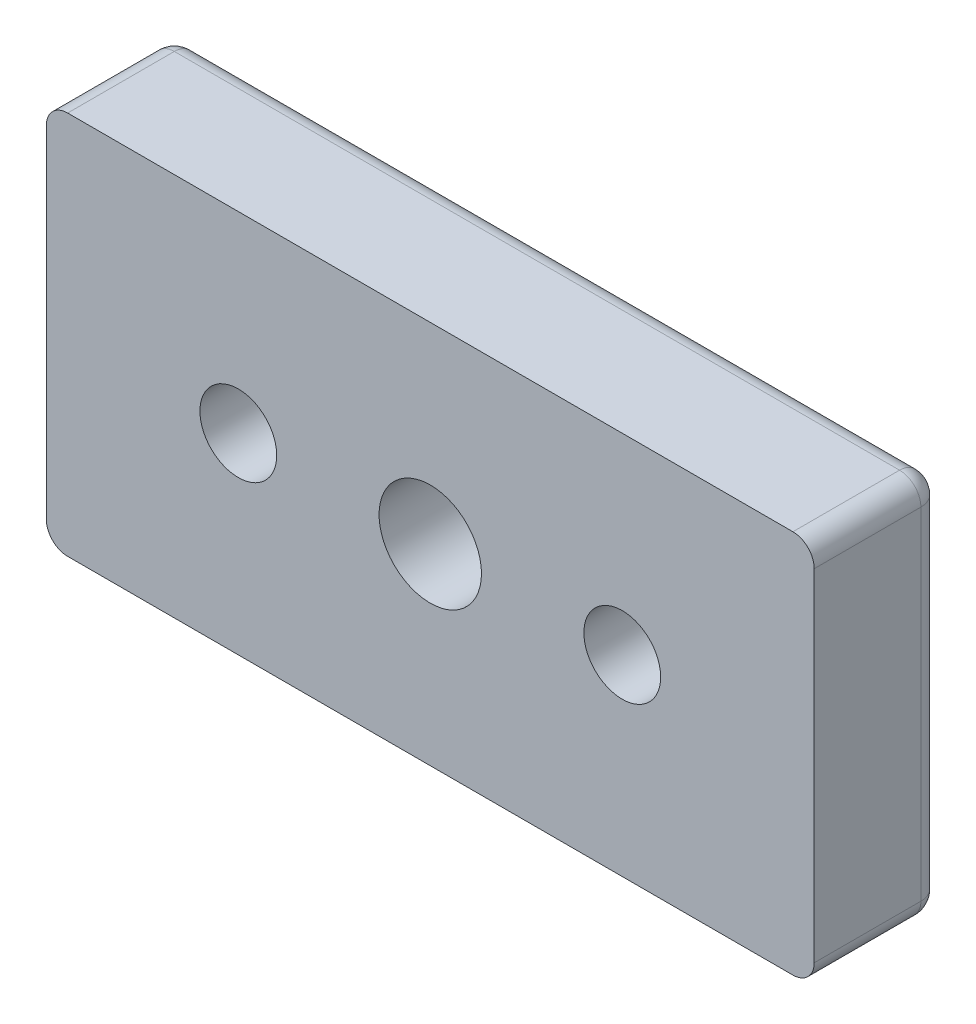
ISO-10303-21;
HEADER;
FILE_DESCRIPTION(('STEP AP214'),'2;1');
FILE_NAME('part.step','',(''),(''),'','','');
FILE_SCHEMA(('AUTOMOTIVE_DESIGN { 1 0 10303 214 1 1 1 1 }'));
ENDSEC;
DATA;
#1=APPLICATION_CONTEXT('core data for automotive mechanical design processes');
#2=APPLICATION_PROTOCOL_DEFINITION('international standard','automotive_design',2000,#1);
#3=PRODUCT_CONTEXT('',#1,'mechanical');
#4=PRODUCT('Part','Part','',(#3));
#5=PRODUCT_RELATED_PRODUCT_CATEGORY('part','',(#4));
#6=PRODUCT_DEFINITION_FORMATION('','',#4);
#7=PRODUCT_DEFINITION_CONTEXT('part definition',#1,'design');
#8=PRODUCT_DEFINITION('design','',#6,#7);
#9=PRODUCT_DEFINITION_SHAPE('','',#8);
#10=(LENGTH_UNIT() NAMED_UNIT(*) SI_UNIT(.MILLI.,.METRE.));
#11=(NAMED_UNIT(*) PLANE_ANGLE_UNIT() SI_UNIT($,.RADIAN.));
#12=(NAMED_UNIT(*) SI_UNIT($,.STERADIAN.) SOLID_ANGLE_UNIT());
#13=UNCERTAINTY_MEASURE_WITH_UNIT(LENGTH_MEASURE(1.E-05),#10,'distance_accuracy_value','');
#14=(GEOMETRIC_REPRESENTATION_CONTEXT(3) GLOBAL_UNCERTAINTY_ASSIGNED_CONTEXT((#13)) GLOBAL_UNIT_ASSIGNED_CONTEXT((#10,
#11,#12)) REPRESENTATION_CONTEXT('',''));
#15=CARTESIAN_POINT('',(0.,0.,0.));
#16=DIRECTION('',(0.,0.,1.));
#17=DIRECTION('',(1.,0.,0.));
#18=AXIS2_PLACEMENT_3D('',#15,#16,#17);
#19=CARTESIAN_POINT('',(22.5,0.,0.));
#20=DIRECTION('',(0.,0.,1.));
#21=DIRECTION('',(1.,0.,0.));
#22=AXIS2_PLACEMENT_3D('',#19,#20,#21);
#23=CYLINDRICAL_SURFACE('',#22,7.5);
#24=CARTESIAN_POINT('',(22.5,0.,5.5));
#25=DIRECTION('',(0.,0.,1.));
#26=DIRECTION('',(1.,0.,0.));
#27=AXIS2_PLACEMENT_3D('',#24,#25,#26);
#28=CIRCLE('',#27,7.5);
#29=CARTESIAN_POINT('',(30.,0.,5.5));
#30=VERTEX_POINT('',#29);
#31=EDGE_CURVE('E111',#30,#30,#28,.T.);
#32=ORIENTED_EDGE('',*,*,#31,.T.);
#33=EDGE_LOOP('',(#32));
#34=FACE_BOUND('',#33,.T.);
#35=CARTESIAN_POINT('',(22.5,0.,0.));
#36=DIRECTION('',(0.,0.,1.));
#37=DIRECTION('',(1.,0.,0.));
#38=AXIS2_PLACEMENT_3D('',#35,#36,#37);
#39=CIRCLE('',#38,7.5);
#40=CARTESIAN_POINT('',(30.,0.,0.));
#41=VERTEX_POINT('',#40);
#42=EDGE_CURVE('E113',#41,#41,#39,.F.);
#43=ORIENTED_EDGE('',*,*,#42,.T.);
#44=EDGE_LOOP('',(#43));
#45=FACE_BOUND('',#44,.T.);
#46=ADVANCED_FACE('F15',(#34,#45),#23,.F.);
#47=CARTESIAN_POINT('',(-22.5,0.,0.));
#48=DIRECTION('',(0.,0.,1.));
#49=DIRECTION('',(1.,0.,0.));
#50=AXIS2_PLACEMENT_3D('',#47,#48,#49);
#51=CYLINDRICAL_SURFACE('',#50,7.5);
#52=CARTESIAN_POINT('',(-22.5,0.,5.5));
#53=DIRECTION('',(0.,0.,1.));
#54=DIRECTION('',(1.,0.,0.));
#55=AXIS2_PLACEMENT_3D('',#52,#53,#54);
#56=CIRCLE('',#55,7.5);
#57=CARTESIAN_POINT('',(-15.,0.,5.5));
#58=VERTEX_POINT('',#57);
#59=EDGE_CURVE('E107',#58,#58,#56,.T.);
#60=ORIENTED_EDGE('',*,*,#59,.T.);
#61=EDGE_LOOP('',(#60));
#62=FACE_BOUND('',#61,.T.);
#63=CARTESIAN_POINT('',(-22.5,0.,0.));
#64=DIRECTION('',(0.,0.,1.));
#65=DIRECTION('',(1.,0.,0.));
#66=AXIS2_PLACEMENT_3D('',#63,#64,#65);
#67=CIRCLE('',#66,7.5);
#68=CARTESIAN_POINT('',(-15.,0.,0.));
#69=VERTEX_POINT('',#68);
#70=EDGE_CURVE('E19',#69,#69,#67,.F.);
#71=ORIENTED_EDGE('',*,*,#70,.T.);
#72=EDGE_LOOP('',(#71));
#73=FACE_BOUND('',#72,.T.);
#74=ADVANCED_FACE('F288',(#62,#73),#51,.F.);
#75=CARTESIAN_POINT('',(-21.25,20.,2.5));
#76=DIRECTION('',(-1.,0.,0.));
#77=DIRECTION('',(0.,0.,1.));
#78=AXIS2_PLACEMENT_3D('',#75,#76,#77);
#79=CYLINDRICAL_SURFACE('',#78,2.5);
#80=CARTESIAN_POINT('',(-42.5,20.,2.5));
#81=DIRECTION('',(1.,0.,0.));
#82=DIRECTION('',(0.,1.,0.));
#83=AXIS2_PLACEMENT_3D('',#80,#81,#82);
#84=CIRCLE('',#83,2.5);
#85=CARTESIAN_POINT('',(-42.5,22.5,2.5));
#86=VERTEX_POINT('',#85);
#87=CARTESIAN_POINT('',(-42.5,20.,0.));
#88=VERTEX_POINT('',#87);
#89=EDGE_CURVE('E235',#86,#88,#84,.F.);
#90=ORIENTED_EDGE('',*,*,#89,.F.);
#91=DIRECTION('',(1.,0.,0.));
#92=VECTOR('',#91,1.);
#93=CARTESIAN_POINT('',(-42.5,22.5,2.5));
#94=LINE('',#93,#92);
#95=CARTESIAN_POINT('',(42.5,22.5,2.5));
#96=VERTEX_POINT('',#95);
#97=EDGE_CURVE('E110',#96,#86,#94,.F.);
#98=ORIENTED_EDGE('',*,*,#97,.F.);
#99=CARTESIAN_POINT('',(42.5,20.,2.5));
#100=DIRECTION('',(1.,0.,0.));
#101=DIRECTION('',(0.,1.,0.));
#102=AXIS2_PLACEMENT_3D('',#99,#100,#101);
#103=CIRCLE('',#102,2.5);
#104=CARTESIAN_POINT('',(42.5,20.,0.));
#105=VERTEX_POINT('',#104);
#106=EDGE_CURVE('E249',#105,#96,#103,.T.);
#107=ORIENTED_EDGE('',*,*,#106,.F.);
#108=DIRECTION('',(1.,0.,0.));
#109=VECTOR('',#108,1.);
#110=CARTESIAN_POINT('',(0.,20.,0.));
#111=LINE('',#110,#109);
#112=EDGE_CURVE('E131',#105,#88,#111,.F.);
#113=ORIENTED_EDGE('',*,*,#112,.T.);
#114=EDGE_LOOP('',(#90,#98,#107,#113));
#115=FACE_BOUND('',#114,.T.);
#116=ADVANCED_FACE('F228',(#115),#79,.T.);
#117=CARTESIAN_POINT('',(-42.5,20.,2.5));
#118=DIRECTION('',(1.,0.,0.));
#119=DIRECTION('',(0.,1.,0.));
#120=AXIS2_PLACEMENT_3D('',#117,#118,#119);
#121=SPHERICAL_SURFACE('',#120,2.5);
#122=CARTESIAN_POINT('',(-42.5,20.,2.5));
#123=DIRECTION('',(0.,0.,1.));
#124=DIRECTION('',(1.,0.,0.));
#125=AXIS2_PLACEMENT_3D('',#122,#123,#124);
#126=CIRCLE('',#125,2.5);
#127=CARTESIAN_POINT('',(-45.,20.,2.5));
#128=VERTEX_POINT('',#127);
#129=EDGE_CURVE('E73',#86,#128,#126,.T.);
#130=ORIENTED_EDGE('',*,*,#129,.F.);
#131=ORIENTED_EDGE('',*,*,#89,.T.);
#132=CARTESIAN_POINT('',(-42.5,20.,2.5));
#133=DIRECTION('',(0.,-1.,0.));
#134=DIRECTION('',(0.,0.,-1.));
#135=AXIS2_PLACEMENT_3D('',#132,#133,#134);
#136=CIRCLE('',#135,2.5);
#137=EDGE_CURVE('E234',#128,#88,#136,.T.);
#138=ORIENTED_EDGE('',*,*,#137,.F.);
#139=EDGE_LOOP('',(#130,#131,#138));
#140=FACE_BOUND('',#139,.T.);
#141=ADVANCED_FACE('F223',(#140),#121,.T.);
#142=CARTESIAN_POINT('',(-42.5,-10.,2.5));
#143=DIRECTION('',(0.,-1.,0.));
#144=DIRECTION('',(0.,0.,-1.));
#145=AXIS2_PLACEMENT_3D('',#142,#143,#144);
#146=CYLINDRICAL_SURFACE('',#145,2.5);
#147=CARTESIAN_POINT('',(-42.5,-20.,2.5));
#148=DIRECTION('',(0.,1.,0.));
#149=DIRECTION('',(1.,0.,0.));
#150=AXIS2_PLACEMENT_3D('',#147,#148,#149);
#151=CIRCLE('',#150,2.5);
#152=CARTESIAN_POINT('',(-45.,-20.,2.5));
#153=VERTEX_POINT('',#152);
#154=CARTESIAN_POINT('',(-42.5,-20.,0.));
#155=VERTEX_POINT('',#154);
#156=EDGE_CURVE('E211',#153,#155,#151,.F.);
#157=ORIENTED_EDGE('',*,*,#156,.F.);
#158=DIRECTION('',(0.,1.,0.));
#159=VECTOR('',#158,1.);
#160=CARTESIAN_POINT('',(-45.,-20.,2.5));
#161=LINE('',#160,#159);
#162=EDGE_CURVE('E77',#128,#153,#161,.F.);
#163=ORIENTED_EDGE('',*,*,#162,.F.);
#164=ORIENTED_EDGE('',*,*,#137,.T.);
#165=DIRECTION('',(0.,1.,0.));
#166=VECTOR('',#165,1.);
#167=CARTESIAN_POINT('',(-42.5,0.,0.));
#168=LINE('',#167,#166);
#169=EDGE_CURVE('E122',#88,#155,#168,.F.);
#170=ORIENTED_EDGE('',*,*,#169,.T.);
#171=EDGE_LOOP('',(#157,#163,#164,#170));
#172=FACE_BOUND('',#171,.T.);
#173=ADVANCED_FACE('F219',(#172),#146,.T.);
#174=CARTESIAN_POINT('',(-42.5,-20.,2.5));
#175=DIRECTION('',(1.,0.,0.));
#176=DIRECTION('',(0.,1.,0.));
#177=AXIS2_PLACEMENT_3D('',#174,#175,#176);
#178=SPHERICAL_SURFACE('',#177,2.5);
#179=CARTESIAN_POINT('',(-42.5,-20.,2.5));
#180=DIRECTION('',(0.,0.,1.));
#181=DIRECTION('',(1.,0.,0.));
#182=AXIS2_PLACEMENT_3D('',#179,#180,#181);
#183=CIRCLE('',#182,2.50000000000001);
#184=CARTESIAN_POINT('',(-42.5,-22.5,2.5));
#185=VERTEX_POINT('',#184);
#186=EDGE_CURVE('E76',#153,#185,#183,.T.);
#187=ORIENTED_EDGE('',*,*,#186,.F.);
#188=ORIENTED_EDGE('',*,*,#156,.T.);
#189=CARTESIAN_POINT('',(-42.5,-20.,2.5));
#190=DIRECTION('',(1.,0.,0.));
#191=DIRECTION('',(0.,0.,-1.));
#192=AXIS2_PLACEMENT_3D('',#189,#190,#191);
#193=CIRCLE('',#192,2.5);
#194=EDGE_CURVE('E207',#185,#155,#193,.T.);
#195=ORIENTED_EDGE('',*,*,#194,.F.);
#196=EDGE_LOOP('',(#187,#188,#195));
#197=FACE_BOUND('',#196,.T.);
#198=ADVANCED_FACE('F216',(#197),#178,.T.);
#199=CARTESIAN_POINT('',(21.25,-20.,2.5));
#200=DIRECTION('',(1.,0.,0.));
#201=DIRECTION('',(0.,0.,-1.));
#202=AXIS2_PLACEMENT_3D('',#199,#200,#201);
#203=CYLINDRICAL_SURFACE('',#202,2.5);
#204=CARTESIAN_POINT('',(42.5,-20.,2.5));
#205=DIRECTION('',(1.,0.,0.));
#206=DIRECTION('',(0.,1.,0.));
#207=AXIS2_PLACEMENT_3D('',#204,#205,#206);
#208=CIRCLE('',#207,2.5);
#209=CARTESIAN_POINT('',(42.5,-22.5,2.50000000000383));
#210=VERTEX_POINT('',#209);
#211=CARTESIAN_POINT('',(42.5,-20.,0.));
#212=VERTEX_POINT('',#211);
#213=EDGE_CURVE('E203',#210,#212,#208,.T.);
#214=ORIENTED_EDGE('',*,*,#213,.F.);
#215=DIRECTION('',(1.,0.,0.));
#216=VECTOR('',#215,1.);
#217=CARTESIAN_POINT('',(42.5,-22.5,2.5));
#218=LINE('',#217,#216);
#219=EDGE_CURVE('E169',#185,#210,#218,.T.);
#220=ORIENTED_EDGE('',*,*,#219,.F.);
#221=ORIENTED_EDGE('',*,*,#194,.T.);
#222=DIRECTION('',(1.,0.,0.));
#223=VECTOR('',#222,1.);
#224=CARTESIAN_POINT('',(0.,-20.,0.));
#225=LINE('',#224,#223);
#226=EDGE_CURVE('E118',#155,#212,#225,.T.);
#227=ORIENTED_EDGE('',*,*,#226,.T.);
#228=EDGE_LOOP('',(#214,#220,#221,#227));
#229=FACE_BOUND('',#228,.T.);
#230=ADVANCED_FACE('F196',(#229),#203,.T.);
#231=CARTESIAN_POINT('',(42.5,-20.,2.5));
#232=DIRECTION('',(1.,0.,0.));
#233=DIRECTION('',(0.,1.,0.));
#234=AXIS2_PLACEMENT_3D('',#231,#232,#233);
#235=SPHERICAL_SURFACE('',#234,2.5);
#236=CARTESIAN_POINT('',(42.5,-20.,2.5));
#237=DIRECTION('',(0.,0.,1.));
#238=DIRECTION('',(1.,0.,0.));
#239=AXIS2_PLACEMENT_3D('',#236,#237,#238);
#240=CIRCLE('',#239,2.5);
#241=CARTESIAN_POINT('',(45.,-20.,2.5));
#242=VERTEX_POINT('',#241);
#243=EDGE_CURVE('E165',#210,#242,#240,.T.);
#244=ORIENTED_EDGE('',*,*,#243,.F.);
#245=ORIENTED_EDGE('',*,*,#213,.T.);
#246=CARTESIAN_POINT('',(42.5,-20.,2.5));
#247=DIRECTION('',(0.,1.,0.));
#248=DIRECTION('',(0.,0.,1.));
#249=AXIS2_PLACEMENT_3D('',#246,#247,#248);
#250=CIRCLE('',#249,2.5);
#251=EDGE_CURVE('E206',#242,#212,#250,.T.);
#252=ORIENTED_EDGE('',*,*,#251,.F.);
#253=EDGE_LOOP('',(#244,#245,#252));
#254=FACE_BOUND('',#253,.T.);
#255=ADVANCED_FACE('F191',(#254),#235,.T.);
#256=CARTESIAN_POINT('',(42.5,10.,2.5));
#257=DIRECTION('',(0.,1.,0.));
#258=DIRECTION('',(0.,0.,1.));
#259=AXIS2_PLACEMENT_3D('',#256,#257,#258);
#260=CYLINDRICAL_SURFACE('',#259,2.5);
#261=CARTESIAN_POINT('',(42.5,20.,2.5));
#262=DIRECTION('',(0.,1.,0.));
#263=DIRECTION('',(1.,0.,0.));
#264=AXIS2_PLACEMENT_3D('',#261,#262,#263);
#265=CIRCLE('',#264,2.5);
#266=CARTESIAN_POINT('',(45.,20.,2.5));
#267=VERTEX_POINT('',#266);
#268=EDGE_CURVE('E178',#267,#105,#265,.T.);
#269=ORIENTED_EDGE('',*,*,#268,.F.);
#270=DIRECTION('',(0.,1.,0.));
#271=VECTOR('',#270,1.);
#272=CARTESIAN_POINT('',(45.,20.,2.5));
#273=LINE('',#272,#271);
#274=EDGE_CURVE('E161',#242,#267,#273,.T.);
#275=ORIENTED_EDGE('',*,*,#274,.F.);
#276=ORIENTED_EDGE('',*,*,#251,.T.);
#277=DIRECTION('',(0.,1.,0.));
#278=VECTOR('',#277,1.);
#279=CARTESIAN_POINT('',(42.5,0.,0.));
#280=LINE('',#279,#278);
#281=EDGE_CURVE('E134',#212,#105,#280,.T.);
#282=ORIENTED_EDGE('',*,*,#281,.T.);
#283=EDGE_LOOP('',(#269,#275,#276,#282));
#284=FACE_BOUND('',#283,.T.);
#285=ADVANCED_FACE('F186',(#284),#260,.T.);
#286=CARTESIAN_POINT('',(42.5,20.,2.5));
#287=DIRECTION('',(1.,0.,0.));
#288=DIRECTION('',(0.,1.,0.));
#289=AXIS2_PLACEMENT_3D('',#286,#287,#288);
#290=SPHERICAL_SURFACE('',#289,2.5);
#291=CARTESIAN_POINT('',(42.5,20.,2.5));
#292=DIRECTION('',(0.,0.,1.));
#293=DIRECTION('',(1.,0.,0.));
#294=AXIS2_PLACEMENT_3D('',#291,#292,#293);
#295=CIRCLE('',#294,2.5);
#296=EDGE_CURVE('E156',#267,#96,#295,.T.);
#297=ORIENTED_EDGE('',*,*,#296,.F.);
#298=ORIENTED_EDGE('',*,*,#268,.T.);
#299=ORIENTED_EDGE('',*,*,#106,.T.);
#300=EDGE_LOOP('',(#297,#298,#299));
#301=FACE_BOUND('',#300,.T.);
#302=ADVANCED_FACE('F181',(#301),#290,.T.);
#303=CARTESIAN_POINT('',(0.,0.,0.));
#304=DIRECTION('',(0.,0.,1.));
#305=DIRECTION('',(1.,0.,0.));
#306=AXIS2_PLACEMENT_3D('',#303,#304,#305);
#307=PLANE('',#306);
#308=ORIENTED_EDGE('',*,*,#42,.F.);
#309=EDGE_LOOP('',(#308));
#310=FACE_BOUND('',#309,.T.);
#311=ORIENTED_EDGE('',*,*,#70,.F.);
#312=EDGE_LOOP('',(#311));
#313=FACE_BOUND('',#312,.T.);
#314=CARTESIAN_POINT('',(0.,0.,0.));
#315=DIRECTION('',(0.,0.,1.));
#316=DIRECTION('',(1.,0.,0.));
#317=AXIS2_PLACEMENT_3D('',#314,#315,#316);
#318=CIRCLE('',#317,6.);
#319=CARTESIAN_POINT('',(6.,0.,0.));
#320=VERTEX_POINT('',#319);
#321=EDGE_CURVE('E104',#320,#320,#318,.T.);
#322=ORIENTED_EDGE('',*,*,#321,.T.);
#323=EDGE_LOOP('',(#322));
#324=FACE_BOUND('',#323,.T.);
#325=ORIENTED_EDGE('',*,*,#169,.F.);
#326=ORIENTED_EDGE('',*,*,#112,.F.);
#327=ORIENTED_EDGE('',*,*,#281,.F.);
#328=ORIENTED_EDGE('',*,*,#226,.F.);
#329=EDGE_LOOP('',(#325,#326,#327,#328));
#330=FACE_BOUND('',#329,.T.);
#331=ADVANCED_FACE('F185',(#310,#313,#324,#330),#307,.F.);
#332=CARTESIAN_POINT('',(30.15,7.65,5.5));
#333=DIRECTION('',(0.,0.,1.));
#334=DIRECTION('',(-1.,0.,0.));
#335=AXIS2_PLACEMENT_3D('',#332,#333,#334);
#336=PLANE('',#335);
#337=CARTESIAN_POINT('',(22.5,0.,5.5));
#338=DIRECTION('',(0.,0.,1.));
#339=DIRECTION('',(1.,0.,0.));
#340=AXIS2_PLACEMENT_3D('',#337,#338,#339);
#341=CIRCLE('',#340,4.5);
#342=CARTESIAN_POINT('',(27.,0.,5.5));
#343=VERTEX_POINT('',#342);
#344=EDGE_CURVE('E101',#343,#343,#341,.T.);
#345=ORIENTED_EDGE('',*,*,#344,.T.);
#346=EDGE_LOOP('',(#345));
#347=FACE_BOUND('',#346,.T.);
#348=ORIENTED_EDGE('',*,*,#31,.F.);
#349=EDGE_LOOP('',(#348));
#350=FACE_BOUND('',#349,.T.);
#351=ADVANCED_FACE('F335',(#347,#350),#336,.F.);
#352=CARTESIAN_POINT('',(-14.85,7.65,5.5));
#353=DIRECTION('',(0.,0.,1.));
#354=DIRECTION('',(-1.,0.,0.));
#355=AXIS2_PLACEMENT_3D('',#352,#353,#354);
#356=PLANE('',#355);
#357=CARTESIAN_POINT('',(-22.5,0.,5.5));
#358=DIRECTION('',(0.,0.,1.));
#359=DIRECTION('',(1.,0.,0.));
#360=AXIS2_PLACEMENT_3D('',#357,#358,#359);
#361=CIRCLE('',#360,4.5);
#362=CARTESIAN_POINT('',(-18.,0.,5.5));
#363=VERTEX_POINT('',#362);
#364=EDGE_CURVE('E94',#363,#363,#361,.T.);
#365=ORIENTED_EDGE('',*,*,#364,.T.);
#366=EDGE_LOOP('',(#365));
#367=FACE_BOUND('',#366,.T.);
#368=ORIENTED_EDGE('',*,*,#59,.F.);
#369=EDGE_LOOP('',(#368));
#370=FACE_BOUND('',#369,.T.);
#371=ADVANCED_FACE('F17',(#367,#370),#356,.F.);
#372=CARTESIAN_POINT('',(-42.5,22.5,0.));
#373=DIRECTION('',(0.,1.,0.));
#374=DIRECTION('',(0.,0.,1.));
#375=AXIS2_PLACEMENT_3D('',#372,#373,#374);
#376=PLANE('',#375);
#377=DIRECTION('',(1.,0.,0.));
#378=VECTOR('',#377,1.);
#379=CARTESIAN_POINT('',(0.,22.5,15.));
#380=LINE('',#379,#378);
#381=CARTESIAN_POINT('',(42.5,22.5,15.));
#382=VERTEX_POINT('',#381);
#383=CARTESIAN_POINT('',(-42.5,22.5,15.));
#384=VERTEX_POINT('',#383);
#385=EDGE_CURVE('E92',#382,#384,#380,.F.);
#386=ORIENTED_EDGE('',*,*,#385,.F.);
#387=DIRECTION('',(0.,0.,1.));
#388=VECTOR('',#387,1.);
#389=CARTESIAN_POINT('',(42.5,22.5,0.));
#390=LINE('',#389,#388);
#391=EDGE_CURVE('E153',#96,#382,#390,.T.);
#392=ORIENTED_EDGE('',*,*,#391,.F.);
#393=ORIENTED_EDGE('',*,*,#97,.T.);
#394=DIRECTION('',(0.,0.,1.));
#395=VECTOR('',#394,1.);
#396=CARTESIAN_POINT('',(-42.5,22.5,0.));
#397=LINE('',#396,#395);
#398=EDGE_CURVE('E59',#384,#86,#397,.F.);
#399=ORIENTED_EDGE('',*,*,#398,.F.);
#400=EDGE_LOOP('',(#386,#392,#393,#399));
#401=FACE_BOUND('',#400,.T.);
#402=ADVANCED_FACE('F268',(#401),#376,.T.);
#403=CARTESIAN_POINT('',(-42.5,20.,0.));
#404=DIRECTION('',(0.,0.,1.));
#405=DIRECTION('',(1.,0.,0.));
#406=AXIS2_PLACEMENT_3D('',#403,#404,#405);
#407=CYLINDRICAL_SURFACE('',#406,2.5);
#408=CARTESIAN_POINT('',(-42.5,20.,15.));
#409=DIRECTION('',(0.,0.,1.));
#410=DIRECTION('',(1.,0.,0.));
#411=AXIS2_PLACEMENT_3D('',#408,#409,#410);
#412=CIRCLE('',#411,2.5);
#413=CARTESIAN_POINT('',(-45.,20.,15.));
#414=VERTEX_POINT('',#413);
#415=EDGE_CURVE('E69',#384,#414,#412,.T.);
#416=ORIENTED_EDGE('',*,*,#415,.F.);
#417=ORIENTED_EDGE('',*,*,#398,.T.);
#418=ORIENTED_EDGE('',*,*,#129,.T.);
#419=DIRECTION('',(0.,0.,1.));
#420=VECTOR('',#419,1.);
#421=CARTESIAN_POINT('',(-45.,20.,0.));
#422=LINE('',#421,#420);
#423=EDGE_CURVE('E65',#414,#128,#422,.F.);
#424=ORIENTED_EDGE('',*,*,#423,.F.);
#425=EDGE_LOOP('',(#416,#417,#418,#424));
#426=FACE_BOUND('',#425,.T.);
#427=ADVANCED_FACE('F67',(#426),#407,.T.);
#428=CARTESIAN_POINT('',(-45.,-20.,0.));
#429=DIRECTION('',(-1.,0.,0.));
#430=DIRECTION('',(0.,0.,1.));
#431=AXIS2_PLACEMENT_3D('',#428,#429,#430);
#432=PLANE('',#431);
#433=DIRECTION('',(0.,1.,0.));
#434=VECTOR('',#433,1.);
#435=CARTESIAN_POINT('',(-45.,0.,15.));
#436=LINE('',#435,#434);
#437=CARTESIAN_POINT('',(-45.,-20.,15.));
#438=VERTEX_POINT('',#437);
#439=EDGE_CURVE('E80',#414,#438,#436,.F.);
#440=ORIENTED_EDGE('',*,*,#439,.F.);
#441=ORIENTED_EDGE('',*,*,#423,.T.);
#442=ORIENTED_EDGE('',*,*,#162,.T.);
#443=DIRECTION('',(0.,0.,1.));
#444=VECTOR('',#443,1.);
#445=CARTESIAN_POINT('',(-45.,-20.,0.));
#446=LINE('',#445,#444);
#447=EDGE_CURVE('E83',#438,#153,#446,.F.);
#448=ORIENTED_EDGE('',*,*,#447,.F.);
#449=EDGE_LOOP('',(#440,#441,#442,#448));
#450=FACE_BOUND('',#449,.T.);
#451=ADVANCED_FACE('F81',(#450),#432,.T.);
#452=CARTESIAN_POINT('',(-42.5,-20.,0.));
#453=DIRECTION('',(0.,0.,1.));
#454=DIRECTION('',(1.,0.,0.));
#455=AXIS2_PLACEMENT_3D('',#452,#453,#454);
#456=CYLINDRICAL_SURFACE('',#455,2.50000000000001);
#457=CARTESIAN_POINT('',(-42.5,-20.,15.));
#458=DIRECTION('',(0.,0.,1.));
#459=DIRECTION('',(1.,0.,0.));
#460=AXIS2_PLACEMENT_3D('',#457,#458,#459);
#461=CIRCLE('',#460,2.50000000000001);
#462=CARTESIAN_POINT('',(-42.5,-22.5,15.));
#463=VERTEX_POINT('',#462);
#464=EDGE_CURVE('E87',#438,#463,#461,.T.);
#465=ORIENTED_EDGE('',*,*,#464,.F.);
#466=ORIENTED_EDGE('',*,*,#447,.T.);
#467=ORIENTED_EDGE('',*,*,#186,.T.);
#468=DIRECTION('',(0.,0.,-1.));
#469=VECTOR('',#468,1.);
#470=CARTESIAN_POINT('',(-42.5,-22.5,0.));
#471=LINE('',#470,#469);
#472=EDGE_CURVE('E166',#463,#185,#471,.T.);
#473=ORIENTED_EDGE('',*,*,#472,.F.);
#474=EDGE_LOOP('',(#465,#466,#467,#473));
#475=FACE_BOUND('',#474,.T.);
#476=ADVANCED_FACE('F323',(#475),#456,.T.);
#477=CARTESIAN_POINT('',(42.5,-22.5,0.));
#478=DIRECTION('',(0.,-1.,0.));
#479=DIRECTION('',(0.,0.,-1.));
#480=AXIS2_PLACEMENT_3D('',#477,#478,#479);
#481=PLANE('',#480);
#482=DIRECTION('',(1.,0.,0.));
#483=VECTOR('',#482,1.);
#484=CARTESIAN_POINT('',(0.,-22.5,15.));
#485=LINE('',#484,#483);
#486=CARTESIAN_POINT('',(42.5,-22.5,15.));
#487=VERTEX_POINT('',#486);
#488=EDGE_CURVE('E146',#463,#487,#485,.T.);
#489=ORIENTED_EDGE('',*,*,#488,.F.);
#490=ORIENTED_EDGE('',*,*,#472,.T.);
#491=ORIENTED_EDGE('',*,*,#219,.T.);
#492=DIRECTION('',(0.,0.,1.));
#493=VECTOR('',#492,1.);
#494=CARTESIAN_POINT('',(42.5,-22.5,0.));
#495=LINE('',#494,#493);
#496=EDGE_CURVE('E162',#487,#210,#495,.F.);
#497=ORIENTED_EDGE('',*,*,#496,.F.);
#498=EDGE_LOOP('',(#489,#490,#491,#497));
#499=FACE_BOUND('',#498,.T.);
#500=ADVANCED_FACE('F320',(#499),#481,.T.);
#501=CARTESIAN_POINT('',(42.5,-20.,0.));
#502=DIRECTION('',(0.,0.,1.));
#503=DIRECTION('',(1.,0.,0.));
#504=AXIS2_PLACEMENT_3D('',#501,#502,#503);
#505=CYLINDRICAL_SURFACE('',#504,2.5);
#506=CARTESIAN_POINT('',(42.5,-20.,15.));
#507=DIRECTION('',(0.,0.,1.));
#508=DIRECTION('',(1.,0.,0.));
#509=AXIS2_PLACEMENT_3D('',#506,#507,#508);
#510=CIRCLE('',#509,2.5);
#511=CARTESIAN_POINT('',(45.,-20.,15.));
#512=VERTEX_POINT('',#511);
#513=EDGE_CURVE('E144',#487,#512,#510,.T.);
#514=ORIENTED_EDGE('',*,*,#513,.F.);
#515=ORIENTED_EDGE('',*,*,#496,.T.);
#516=ORIENTED_EDGE('',*,*,#243,.T.);
#517=DIRECTION('',(0.,0.,-1.));
#518=VECTOR('',#517,1.);
#519=CARTESIAN_POINT('',(45.,-20.,0.));
#520=LINE('',#519,#518);
#521=EDGE_CURVE('E158',#512,#242,#520,.T.);
#522=ORIENTED_EDGE('',*,*,#521,.F.);
#523=EDGE_LOOP('',(#514,#515,#516,#522));
#524=FACE_BOUND('',#523,.T.);
#525=ADVANCED_FACE('F258',(#524),#505,.T.);
#526=CARTESIAN_POINT('',(45.,20.,0.));
#527=DIRECTION('',(1.,0.,0.));
#528=DIRECTION('',(0.,0.,-1.));
#529=AXIS2_PLACEMENT_3D('',#526,#527,#528);
#530=PLANE('',#529);
#531=DIRECTION('',(0.,1.,0.));
#532=VECTOR('',#531,1.);
#533=CARTESIAN_POINT('',(45.,0.,15.));
#534=LINE('',#533,#532);
#535=CARTESIAN_POINT('',(45.,20.,15.));
#536=VERTEX_POINT('',#535);
#537=EDGE_CURVE('E143',#512,#536,#534,.T.);
#538=ORIENTED_EDGE('',*,*,#537,.F.);
#539=ORIENTED_EDGE('',*,*,#521,.T.);
#540=ORIENTED_EDGE('',*,*,#274,.T.);
#541=DIRECTION('',(0.,0.,1.));
#542=VECTOR('',#541,1.);
#543=CARTESIAN_POINT('',(45.,20.,0.));
#544=LINE('',#543,#542);
#545=EDGE_CURVE('E34',#536,#267,#544,.F.);
#546=ORIENTED_EDGE('',*,*,#545,.F.);
#547=EDGE_LOOP('',(#538,#539,#540,#546));
#548=FACE_BOUND('',#547,.T.);
#549=ADVANCED_FACE('F264',(#548),#530,.T.);
#550=CARTESIAN_POINT('',(42.5,20.,0.));
#551=DIRECTION('',(0.,0.,1.));
#552=DIRECTION('',(1.,0.,0.));
#553=AXIS2_PLACEMENT_3D('',#550,#551,#552);
#554=CYLINDRICAL_SURFACE('',#553,2.5);
#555=CARTESIAN_POINT('',(42.5,20.,15.));
#556=DIRECTION('',(0.,0.,1.));
#557=DIRECTION('',(1.,0.,0.));
#558=AXIS2_PLACEMENT_3D('',#555,#556,#557);
#559=CIRCLE('',#558,2.5);
#560=EDGE_CURVE('E142',#536,#382,#559,.T.);
#561=ORIENTED_EDGE('',*,*,#560,.F.);
#562=ORIENTED_EDGE('',*,*,#545,.T.);
#563=ORIENTED_EDGE('',*,*,#296,.T.);
#564=ORIENTED_EDGE('',*,*,#391,.T.);
#565=EDGE_LOOP('',(#561,#562,#563,#564));
#566=FACE_BOUND('',#565,.T.);
#567=ADVANCED_FACE('F267',(#566),#554,.T.);
#568=CARTESIAN_POINT('',(0.,0.,0.));
#569=DIRECTION('',(0.,0.,1.));
#570=DIRECTION('',(1.,0.,0.));
#571=AXIS2_PLACEMENT_3D('',#568,#569,#570);
#572=CYLINDRICAL_SURFACE('',#571,6.);
#573=ORIENTED_EDGE('',*,*,#321,.F.);
#574=EDGE_LOOP('',(#573));
#575=FACE_BOUND('',#574,.T.);
#576=CARTESIAN_POINT('',(0.,0.,15.));
#577=DIRECTION('',(0.,0.,1.));
#578=DIRECTION('',(1.,0.,0.));
#579=AXIS2_PLACEMENT_3D('',#576,#577,#578);
#580=CIRCLE('',#579,6.);
#581=CARTESIAN_POINT('',(6.,0.,15.));
#582=VERTEX_POINT('',#581);
#583=EDGE_CURVE('E139',#582,#582,#580,.F.);
#584=ORIENTED_EDGE('',*,*,#583,.F.);
#585=EDGE_LOOP('',(#584));
#586=FACE_BOUND('',#585,.T.);
#587=ADVANCED_FACE('F309',(#575,#586),#572,.F.);
#588=CARTESIAN_POINT('',(22.5,0.,0.));
#589=DIRECTION('',(0.,0.,1.));
#590=DIRECTION('',(1.,0.,0.));
#591=AXIS2_PLACEMENT_3D('',#588,#589,#590);
#592=CYLINDRICAL_SURFACE('',#591,4.5);
#593=CARTESIAN_POINT('',(22.5,0.,15.));
#594=DIRECTION('',(0.,0.,1.));
#595=DIRECTION('',(1.,0.,0.));
#596=AXIS2_PLACEMENT_3D('',#593,#594,#595);
#597=CIRCLE('',#596,4.5);
#598=CARTESIAN_POINT('',(27.,0.,15.));
#599=VERTEX_POINT('',#598);
#600=EDGE_CURVE('E25',#599,#599,#597,.F.);
#601=ORIENTED_EDGE('',*,*,#600,.F.);
#602=EDGE_LOOP('',(#601));
#603=FACE_BOUND('',#602,.T.);
#604=ORIENTED_EDGE('',*,*,#344,.F.);
#605=EDGE_LOOP('',(#604));
#606=FACE_BOUND('',#605,.T.);
#607=ADVANCED_FACE('F302',(#603,#606),#592,.F.);
#608=CARTESIAN_POINT('',(-22.5,0.,0.));
#609=DIRECTION('',(0.,0.,1.));
#610=DIRECTION('',(1.,0.,0.));
#611=AXIS2_PLACEMENT_3D('',#608,#609,#610);
#612=CYLINDRICAL_SURFACE('',#611,4.5);
#613=CARTESIAN_POINT('',(-22.5,0.,15.));
#614=DIRECTION('',(0.,0.,1.));
#615=DIRECTION('',(1.,0.,0.));
#616=AXIS2_PLACEMENT_3D('',#613,#614,#615);
#617=CIRCLE('',#616,4.5);
#618=CARTESIAN_POINT('',(-18.,0.,15.));
#619=VERTEX_POINT('',#618);
#620=EDGE_CURVE('E10',#619,#619,#617,.F.);
#621=ORIENTED_EDGE('',*,*,#620,.F.);
#622=EDGE_LOOP('',(#621));
#623=FACE_BOUND('',#622,.T.);
#624=ORIENTED_EDGE('',*,*,#364,.F.);
#625=EDGE_LOOP('',(#624));
#626=FACE_BOUND('',#625,.T.);
#627=ADVANCED_FACE('F296',(#623,#626),#612,.F.);
#628=CARTESIAN_POINT('',(0.,0.,15.));
#629=DIRECTION('',(0.,0.,1.));
#630=DIRECTION('',(1.,0.,0.));
#631=AXIS2_PLACEMENT_3D('',#628,#629,#630);
#632=PLANE('',#631);
#633=ORIENTED_EDGE('',*,*,#620,.T.);
#634=EDGE_LOOP('',(#633));
#635=FACE_BOUND('',#634,.T.);
#636=ORIENTED_EDGE('',*,*,#600,.T.);
#637=EDGE_LOOP('',(#636));
#638=FACE_BOUND('',#637,.T.);
#639=ORIENTED_EDGE('',*,*,#583,.T.);
#640=EDGE_LOOP('',(#639));
#641=FACE_BOUND('',#640,.T.);
#642=ORIENTED_EDGE('',*,*,#537,.T.);
#643=ORIENTED_EDGE('',*,*,#560,.T.);
#644=ORIENTED_EDGE('',*,*,#385,.T.);
#645=ORIENTED_EDGE('',*,*,#415,.T.);
#646=ORIENTED_EDGE('',*,*,#439,.T.);
#647=ORIENTED_EDGE('',*,*,#464,.T.);
#648=ORIENTED_EDGE('',*,*,#488,.T.);
#649=ORIENTED_EDGE('',*,*,#513,.T.);
#650=EDGE_LOOP('',(#642,#643,#644,#645,#646,#647,#648,#649));
#651=FACE_BOUND('',#650,.T.);
#652=ADVANCED_FACE('F90',(#635,#638,#641,#651),#632,.T.);
#653=CLOSED_SHELL('',(#46,#74,#116,#141,#173,#198,#230,#255,#285,#302,#331,#351,#371,#402,#427,
#451,#476,#500,#525,#549,#567,#587,#607,#627,#652));
#654=MANIFOLD_SOLID_BREP('B1',#653);
#655=ADVANCED_BREP_SHAPE_REPRESENTATION('',(#18,#654),#14);
#656=SHAPE_DEFINITION_REPRESENTATION(#9,#655);
ENDSEC;
END-ISO-10303-21;
